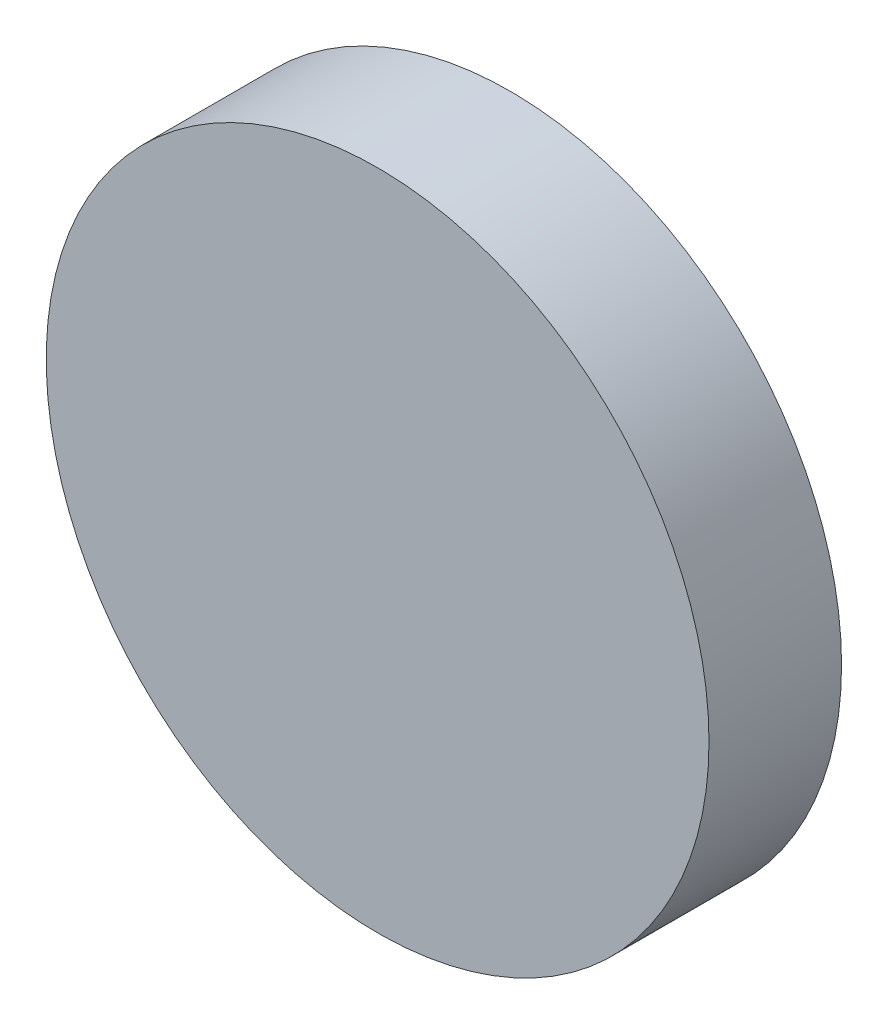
from build123d import *

# Parameters (mm, degrees)
SKETCH_1_R          = 5
EXTRUDE_1_DEPTH     = 2
SKETCH_2_R          = 4
CUT_EXTRUDE_1_DEPTH = 1


with BuildPart() as part:
    # Sketch 1 → Extrude 1 (new body)
    with BuildSketch(Plane.XY):
        Circle(SKETCH_1_R)
    extrude(amount=EXTRUDE_1_DEPTH)

    # Sketch 2 → Cut-Extrude 1 (cut)
    with BuildSketch(Plane(origin=(0, 0, 0), x_dir=(-1, 0, 0), z_dir=(0, 0, -1))):
        Circle(SKETCH_2_R)
    extrude(amount=-CUT_EXTRUDE_1_DEPTH, mode=Mode.SUBTRACT)


solid = part.part
